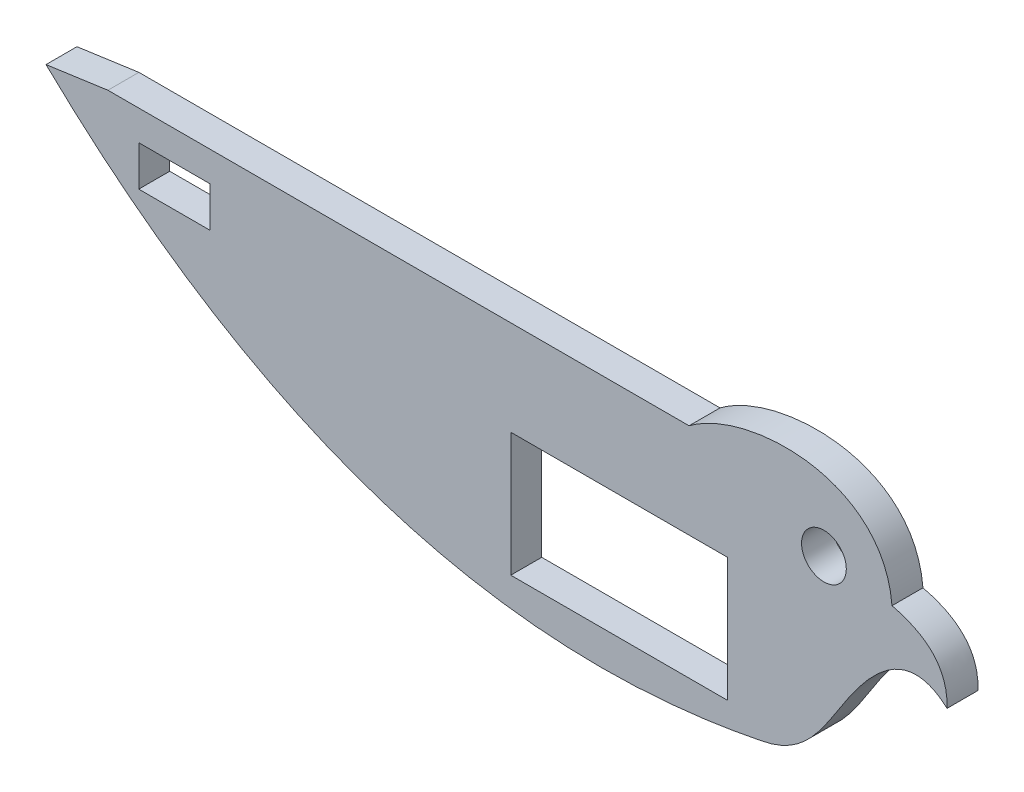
from build123d import *

# Parameters (mm, degrees)
SKETCH2_R           = 7.227324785
SKETCH2_W           = 23
SKETCH2_H           = 13
SKETCH2_W_2         = 70
SKETCH2_H_2         = 40
BOSS_EXTRUDE1_DEPTH = 5


with BuildPart() as part:
    # Sketch2 → Boss-Extrude1 (new, symmetric)
    with BuildSketch(Plane.XY):
        with BuildLine():
            Line((81.876468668, 27.219257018), (-105.830999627, 27.219257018))
            Line((-105.830999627, 27.219257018), (-125.830999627, 24.4008326))
            add(Edge.make_bspline(
                [(105.072009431, -49.251333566), (-22.443184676, -75.115925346), (-125.830999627, 24.4008326)],
                knots=[0, 0, 0, 1, 1, 1], degree=2))
            add(Edge.make_bspline(
                [(165.191064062, -10.177635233), (153.889230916, 0.067226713), (130.107372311, -21.49338859), (121.644554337, -46.276337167), (105.072009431, -49.251333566)],
                knots=[0, 0, 0, 0, 0.442507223, 1, 1, 1, 1], degree=3))
            add(Edge.make_bspline(
                [(147.421809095, 9.661273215), (165.705391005, 5.218855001), (165.191064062, -10.177635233)],
                knots=[0, 0, 0, 1, 1, 1], degree=2))
            add(Edge.make_bspline(
                [(81.876468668, 27.219257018), (101.517598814, 41.934429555), (144.592921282, 42.258760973), (147.421809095, 9.661273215)],
                knots=[0, 0, 0, 0, 1, 1, 1, 1], degree=3))
        make_face()
        with Locations((125.427279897, 12.544527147)):
            Circle(SKETCH2_R, mode=Mode.SUBTRACT)
        with Locations((-84.370796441, 11.034952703)):
            Rectangle(SKETCH2_W, SKETCH2_H, mode=Mode.SUBTRACT)
        with Locations((59.282101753, -23.374772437)):
            Rectangle(SKETCH2_W_2, SKETCH2_H_2, mode=Mode.SUBTRACT)
    extrude(amount=BOSS_EXTRUDE1_DEPTH, both=True)


solid = part.part
